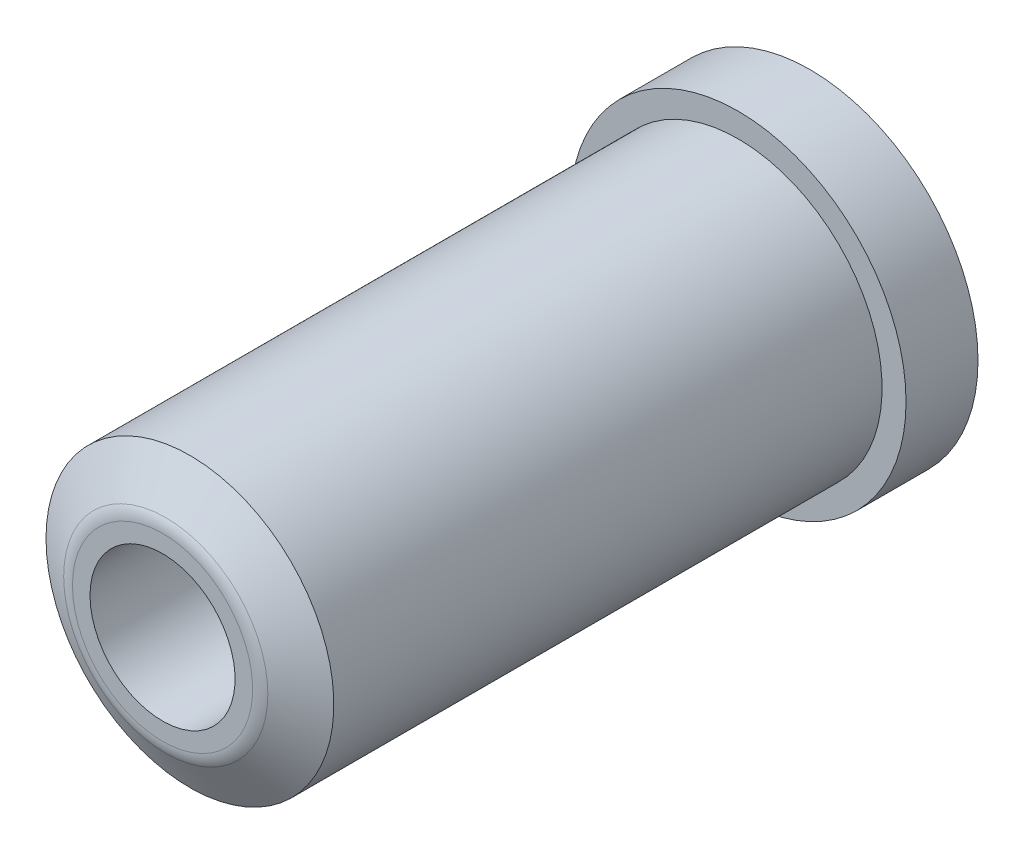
ISO-10303-21;
HEADER;
FILE_DESCRIPTION(('STEP AP214'),'2;1');
FILE_NAME('part.step','',(''),(''),'','','');
FILE_SCHEMA(('AUTOMOTIVE_DESIGN { 1 0 10303 214 1 1 1 1 }'));
ENDSEC;
DATA;
#1=APPLICATION_CONTEXT('core data for automotive mechanical design processes');
#2=APPLICATION_PROTOCOL_DEFINITION('international standard','automotive_design',2000,#1);
#3=PRODUCT_CONTEXT('',#1,'mechanical');
#4=PRODUCT('Part','Part','',(#3));
#5=PRODUCT_RELATED_PRODUCT_CATEGORY('part','',(#4));
#6=PRODUCT_DEFINITION_FORMATION('','',#4);
#7=PRODUCT_DEFINITION_CONTEXT('part definition',#1,'design');
#8=PRODUCT_DEFINITION('design','',#6,#7);
#9=PRODUCT_DEFINITION_SHAPE('','',#8);
#10=(LENGTH_UNIT() NAMED_UNIT(*) SI_UNIT(.MILLI.,.METRE.));
#11=(NAMED_UNIT(*) PLANE_ANGLE_UNIT() SI_UNIT($,.RADIAN.));
#12=(NAMED_UNIT(*) SI_UNIT($,.STERADIAN.) SOLID_ANGLE_UNIT());
#13=UNCERTAINTY_MEASURE_WITH_UNIT(LENGTH_MEASURE(1.E-05),#10,'distance_accuracy_value','');
#14=(GEOMETRIC_REPRESENTATION_CONTEXT(3) GLOBAL_UNCERTAINTY_ASSIGNED_CONTEXT((#13)) GLOBAL_UNIT_ASSIGNED_CONTEXT((#10,
#11,#12)) REPRESENTATION_CONTEXT('',''));
#15=CARTESIAN_POINT('',(0.,0.,0.));
#16=DIRECTION('',(0.,0.,1.));
#17=DIRECTION('',(1.,0.,0.));
#18=AXIS2_PLACEMENT_3D('',#15,#16,#17);
#19=CARTESIAN_POINT('',(-11.1125,0.,0.));
#20=DIRECTION('',(0.,0.,1.));
#21=DIRECTION('',(1.,0.,0.));
#22=AXIS2_PLACEMENT_3D('',#19,#20,#21);
#23=PLANE('',#22);
#24=CARTESIAN_POINT('',(0.,0.,0.));
#25=DIRECTION('',(0.,0.,-1.));
#26=DIRECTION('',(-1.,0.,0.));
#27=AXIS2_PLACEMENT_3D('',#24,#25,#26);
#28=CIRCLE('',#27,4.8006);
#29=CARTESIAN_POINT('',(-4.80060000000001,0.,0.));
#30=VERTEX_POINT('',#29);
#31=EDGE_CURVE('E73',#30,#30,#28,.T.);
#32=ORIENTED_EDGE('',*,*,#31,.F.);
#33=EDGE_LOOP('',(#32));
#34=FACE_BOUND('',#33,.T.);
#35=CARTESIAN_POINT('',(0.,0.,0.));
#36=DIRECTION('',(0.,0.,-1.));
#37=DIRECTION('',(-1.,0.,0.));
#38=AXIS2_PLACEMENT_3D('',#35,#36,#37);
#39=CIRCLE('',#38,11.1125);
#40=CARTESIAN_POINT('',(-11.1125,0.,0.));
#41=VERTEX_POINT('',#40);
#42=EDGE_CURVE('E10',#41,#41,#39,.T.);
#43=ORIENTED_EDGE('',*,*,#42,.T.);
#44=EDGE_LOOP('',(#43));
#45=FACE_BOUND('',#44,.T.);
#46=ADVANCED_FACE('F45',(#34,#45),#23,.F.);
#47=CARTESIAN_POINT('',(0.,0.,-41.5372037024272));
#48=DIRECTION('',(0.,0.,-1.));
#49=DIRECTION('',(-1.,0.,0.));
#50=AXIS2_PLACEMENT_3D('',#47,#48,#49);
#51=CYLINDRICAL_SURFACE('',#50,11.1125);
#52=ORIENTED_EDGE('',*,*,#42,.F.);
#53=EDGE_LOOP('',(#52));
#54=FACE_BOUND('',#53,.T.);
#55=CARTESIAN_POINT('',(0.,0.,4.7625));
#56=DIRECTION('',(0.,0.,-1.));
#57=DIRECTION('',(-1.,0.,0.));
#58=AXIS2_PLACEMENT_3D('',#55,#56,#57);
#59=CIRCLE('',#58,11.1125);
#60=CARTESIAN_POINT('',(-11.1125,0.,4.7625));
#61=VERTEX_POINT('',#60);
#62=EDGE_CURVE('E51',#61,#61,#59,.T.);
#63=ORIENTED_EDGE('',*,*,#62,.T.);
#64=EDGE_LOOP('',(#63));
#65=FACE_BOUND('',#64,.T.);
#66=ADVANCED_FACE('F80',(#54,#65),#51,.T.);
#67=CARTESIAN_POINT('',(-9.52500000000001,0.,4.7625));
#68=DIRECTION('',(0.,0.,-1.));
#69=DIRECTION('',(-1.,0.,0.));
#70=AXIS2_PLACEMENT_3D('',#67,#68,#69);
#71=PLANE('',#70);
#72=ORIENTED_EDGE('',*,*,#62,.F.);
#73=EDGE_LOOP('',(#72));
#74=FACE_BOUND('',#73,.T.);
#75=CARTESIAN_POINT('',(0.,0.,4.7625));
#76=DIRECTION('',(0.,0.,-1.));
#77=DIRECTION('',(-1.,0.,0.));
#78=AXIS2_PLACEMENT_3D('',#75,#76,#77);
#79=CIRCLE('',#78,9.52500000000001);
#80=CARTESIAN_POINT('',(-9.52500000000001,0.,4.7625));
#81=VERTEX_POINT('',#80);
#82=EDGE_CURVE('E55',#81,#81,#79,.T.);
#83=ORIENTED_EDGE('',*,*,#82,.T.);
#84=EDGE_LOOP('',(#83));
#85=FACE_BOUND('',#84,.T.);
#86=ADVANCED_FACE('F84',(#74,#85),#71,.F.);
#87=CARTESIAN_POINT('',(0.,0.,-41.5372037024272));
#88=DIRECTION('',(0.,0.,-1.));
#89=DIRECTION('',(-1.,0.,0.));
#90=AXIS2_PLACEMENT_3D('',#87,#88,#89);
#91=CYLINDRICAL_SURFACE('',#90,9.525);
#92=ORIENTED_EDGE('',*,*,#82,.F.);
#93=EDGE_LOOP('',(#92));
#94=FACE_BOUND('',#93,.T.);
#95=CARTESIAN_POINT('',(0.,0.,41.0514099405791));
#96=DIRECTION('',(0.,0.,-1.));
#97=DIRECTION('',(-1.,0.,0.));
#98=AXIS2_PLACEMENT_3D('',#95,#96,#97);
#99=CIRCLE('',#98,9.525);
#100=CARTESIAN_POINT('',(-9.52500000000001,0.,41.0514099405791));
#101=VERTEX_POINT('',#100);
#102=EDGE_CURVE('E59',#101,#101,#99,.T.);
#103=ORIENTED_EDGE('',*,*,#102,.T.);
#104=EDGE_LOOP('',(#103));
#105=FACE_BOUND('',#104,.T.);
#106=ADVANCED_FACE('F89',(#94,#105),#91,.T.);
#107=CARTESIAN_POINT('',(0.,0.,42.6498153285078));
#108=DIRECTION('',(0.,0.,-1.));
#109=DIRECTION('',(-1.,0.,0.));
#110=AXIS2_PLACEMENT_3D('',#107,#108,#109);
#111=CONICAL_SURFACE('',#110,6.75648065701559,1.04719755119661);
#112=ORIENTED_EDGE('',*,*,#102,.F.);
#113=EDGE_LOOP('',(#112));
#114=FACE_BOUND('',#113,.T.);
#115=CARTESIAN_POINT('',(0.,0.,42.6498153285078));
#116=DIRECTION('',(0.,0.,-1.));
#117=DIRECTION('',(-1.,0.,0.));
#118=AXIS2_PLACEMENT_3D('',#115,#116,#117);
#119=CIRCLE('',#118,6.75648065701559);
#120=CARTESIAN_POINT('',(-6.7564806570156,0.,42.6498153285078));
#121=VERTEX_POINT('',#120);
#122=EDGE_CURVE('E64',#121,#121,#119,.T.);
#123=ORIENTED_EDGE('',*,*,#122,.T.);
#124=EDGE_LOOP('',(#123));
#125=FACE_BOUND('',#124,.T.);
#126=ADVANCED_FACE('F95',(#114,#125),#111,.T.);
#127=CARTESIAN_POINT('',(0.,0.,41.275));
#128=DIRECTION('',(0.,0.,-1.));
#129=DIRECTION('',(-1.,0.,0.));
#130=AXIS2_PLACEMENT_3D('',#127,#128,#129);
#131=TOROIDAL_SURFACE('',#130,5.96273065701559,1.5875);
#132=ORIENTED_EDGE('',*,*,#122,.F.);
#133=EDGE_LOOP('',(#132));
#134=FACE_BOUND('',#133,.T.);
#135=CARTESIAN_POINT('',(0.,0.,42.8625));
#136=DIRECTION('',(0.,0.,-1.));
#137=DIRECTION('',(-1.,0.,0.));
#138=AXIS2_PLACEMENT_3D('',#135,#136,#137);
#139=CIRCLE('',#138,5.96273065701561);
#140=CARTESIAN_POINT('',(-5.96273065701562,0.,42.8625));
#141=VERTEX_POINT('',#140);
#142=EDGE_CURVE('E67',#141,#141,#139,.T.);
#143=ORIENTED_EDGE('',*,*,#142,.T.);
#144=EDGE_LOOP('',(#143));
#145=FACE_BOUND('',#144,.T.);
#146=ADVANCED_FACE('F99',(#134,#145),#131,.T.);
#147=CARTESIAN_POINT('',(-4.80060000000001,0.,42.8625));
#148=DIRECTION('',(0.,0.,-1.));
#149=DIRECTION('',(-1.,0.,0.));
#150=AXIS2_PLACEMENT_3D('',#147,#148,#149);
#151=PLANE('',#150);
#152=ORIENTED_EDGE('',*,*,#142,.F.);
#153=EDGE_LOOP('',(#152));
#154=FACE_BOUND('',#153,.T.);
#155=CARTESIAN_POINT('',(0.,0.,42.8625));
#156=DIRECTION('',(0.,0.,-1.));
#157=DIRECTION('',(-1.,0.,0.));
#158=AXIS2_PLACEMENT_3D('',#155,#156,#157);
#159=CIRCLE('',#158,4.8006);
#160=CARTESIAN_POINT('',(-4.80060000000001,0.,42.8625));
#161=VERTEX_POINT('',#160);
#162=EDGE_CURVE('E70',#161,#161,#159,.T.);
#163=ORIENTED_EDGE('',*,*,#162,.T.);
#164=EDGE_LOOP('',(#163));
#165=FACE_BOUND('',#164,.T.);
#166=ADVANCED_FACE('F103',(#154,#165),#151,.F.);
#167=CARTESIAN_POINT('',(0.,0.,-41.5372037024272));
#168=DIRECTION('',(0.,0.,-1.));
#169=DIRECTION('',(-1.,0.,0.));
#170=AXIS2_PLACEMENT_3D('',#167,#168,#169);
#171=CYLINDRICAL_SURFACE('',#170,4.8006);
#172=ORIENTED_EDGE('',*,*,#162,.F.);
#173=EDGE_LOOP('',(#172));
#174=FACE_BOUND('',#173,.T.);
#175=ORIENTED_EDGE('',*,*,#31,.T.);
#176=EDGE_LOOP('',(#175));
#177=FACE_BOUND('',#176,.T.);
#178=ADVANCED_FACE('F77',(#174,#177),#171,.F.);
#179=CLOSED_SHELL('',(#46,#66,#86,#106,#126,#146,#166,#178));
#180=MANIFOLD_SOLID_BREP('B2',#179);
#181=ADVANCED_BREP_SHAPE_REPRESENTATION('',(#18,#180),#14);
#182=SHAPE_DEFINITION_REPRESENTATION(#9,#181);
ENDSEC;
END-ISO-10303-21;
